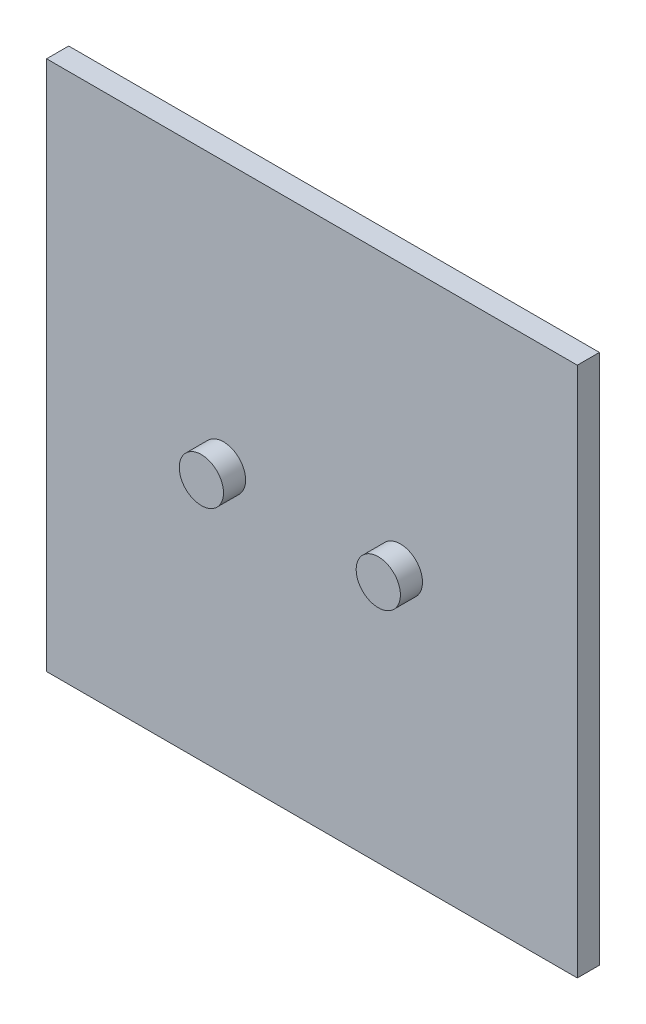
from build123d import *

# Parameters (mm, degrees)
SKETCH1_W      = 76.2
SKETCH1_H      = 76.2
EXTRUDE1_DEPTH = 3.175
SKETCH2_R      = 3.175
EXTRUDE2_DEPTH = 3.175


with BuildPart() as part:
    # Sketch1 → Extrude1 (new body)
    with BuildSketch(Plane.XY):
        with Locations((38.1, 38.1)):
            Rectangle(SKETCH1_W, SKETCH1_H)
    extrude(amount=EXTRUDE1_DEPTH)

    # Sketch2 → Extrude2 (add)
    with BuildSketch(Plane.XY.offset(3.175)):
        with Locations(Location((25.4, 38.1, 0), (0, 0, 180))):
            Circle(SKETCH2_R)
        with Locations(Location((50.8, 38.1, 0), (0, 0, 180))):
            Circle(SKETCH2_R)
    extrude(amount=EXTRUDE2_DEPTH)


solid = part.part
